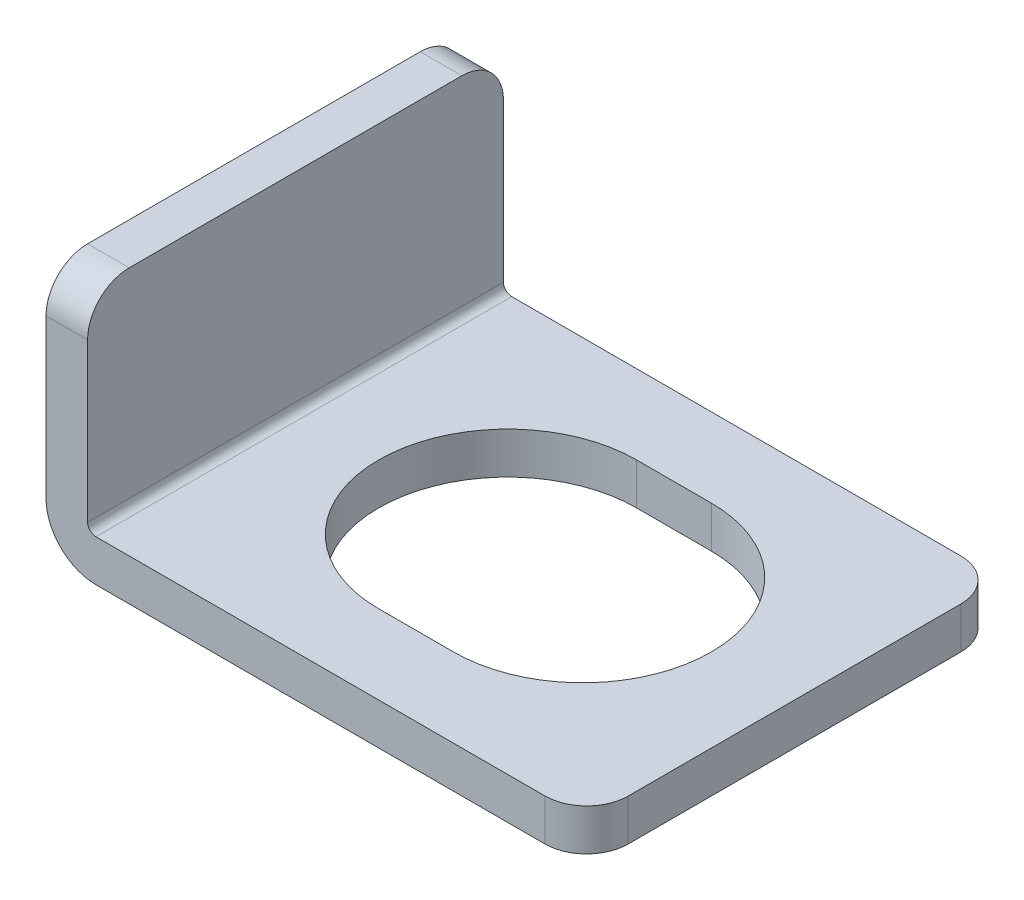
ISO-10303-21;
HEADER;
FILE_DESCRIPTION(('STEP AP214'),'2;1');
FILE_NAME('part.step','',(''),(''),'','','');
FILE_SCHEMA(('AUTOMOTIVE_DESIGN { 1 0 10303 214 1 1 1 1 }'));
ENDSEC;
DATA;
#1=APPLICATION_CONTEXT('core data for automotive mechanical design processes');
#2=APPLICATION_PROTOCOL_DEFINITION('international standard','automotive_design',2000,#1);
#3=PRODUCT_CONTEXT('',#1,'mechanical');
#4=PRODUCT('Part','Part','',(#3));
#5=PRODUCT_RELATED_PRODUCT_CATEGORY('part','',(#4));
#6=PRODUCT_DEFINITION_FORMATION('','',#4);
#7=PRODUCT_DEFINITION_CONTEXT('part definition',#1,'design');
#8=PRODUCT_DEFINITION('design','',#6,#7);
#9=PRODUCT_DEFINITION_SHAPE('','',#8);
#10=(LENGTH_UNIT() NAMED_UNIT(*) SI_UNIT(.MILLI.,.METRE.));
#11=(NAMED_UNIT(*) PLANE_ANGLE_UNIT() SI_UNIT($,.RADIAN.));
#12=(NAMED_UNIT(*) SI_UNIT($,.STERADIAN.) SOLID_ANGLE_UNIT());
#13=UNCERTAINTY_MEASURE_WITH_UNIT(LENGTH_MEASURE(1.E-05),#10,'distance_accuracy_value','');
#14=(GEOMETRIC_REPRESENTATION_CONTEXT(3) GLOBAL_UNCERTAINTY_ASSIGNED_CONTEXT((#13)) GLOBAL_UNIT_ASSIGNED_CONTEXT((#10,
#11,#12)) REPRESENTATION_CONTEXT('',''));
#15=CARTESIAN_POINT('',(0.,0.,0.));
#16=DIRECTION('',(0.,0.,1.));
#17=DIRECTION('',(1.,0.,0.));
#18=AXIS2_PLACEMENT_3D('',#15,#16,#17);
#19=CARTESIAN_POINT('',(0.,6.,5.));
#20=DIRECTION('',(0.,-1.,0.));
#21=DIRECTION('',(0.,0.,-1.));
#22=AXIS2_PLACEMENT_3D('',#19,#20,#21);
#23=PLANE('',#22);
#24=DIRECTION('',(0.,0.,-1.));
#25=VECTOR('',#24,1.);
#26=CARTESIAN_POINT('',(1.,6.,5.));
#27=LINE('',#26,#25);
#28=CARTESIAN_POINT('',(1.,6.,4.));
#29=VERTEX_POINT('',#28);
#30=CARTESIAN_POINT('',(1.,6.,-4.));
#31=VERTEX_POINT('',#30);
#32=EDGE_CURVE('E230',#29,#31,#27,.T.);
#33=ORIENTED_EDGE('',*,*,#32,.T.);
#34=DIRECTION('',(-1.,0.,0.));
#35=VECTOR('',#34,1.);
#36=CARTESIAN_POINT('',(0.,6.,-4.));
#37=LINE('',#36,#35);
#38=CARTESIAN_POINT('',(0.,6.,-4.));
#39=VERTEX_POINT('',#38);
#40=EDGE_CURVE('E283',#31,#39,#37,.T.);
#41=ORIENTED_EDGE('',*,*,#40,.T.);
#42=DIRECTION('',(0.,0.,-1.));
#43=VECTOR('',#42,1.);
#44=CARTESIAN_POINT('',(0.,6.,5.));
#45=LINE('',#44,#43);
#46=CARTESIAN_POINT('',(0.,6.,4.));
#47=VERTEX_POINT('',#46);
#48=EDGE_CURVE('E276',#47,#39,#45,.T.);
#49=ORIENTED_EDGE('',*,*,#48,.F.);
#50=DIRECTION('',(-1.,0.,0.));
#51=VECTOR('',#50,1.);
#52=CARTESIAN_POINT('',(0.,6.,4.));
#53=LINE('',#52,#51);
#54=EDGE_CURVE('E280',#47,#29,#53,.F.);
#55=ORIENTED_EDGE('',*,*,#54,.T.);
#56=EDGE_LOOP('',(#33,#41,#49,#55));
#57=FACE_BOUND('',#56,.T.);
#58=ADVANCED_FACE('F39',(#57),#23,.F.);
#59=CARTESIAN_POINT('',(0.,1.2,5.));
#60=DIRECTION('',(1.,0.,0.));
#61=DIRECTION('',(0.,0.,-1.));
#62=AXIS2_PLACEMENT_3D('',#59,#60,#61);
#63=PLANE('',#62);
#64=ORIENTED_EDGE('',*,*,#48,.T.);
#65=CARTESIAN_POINT('',(0.,5.,-4.));
#66=DIRECTION('',(1.,0.,0.));
#67=DIRECTION('',(0.,0.,-1.));
#68=AXIS2_PLACEMENT_3D('',#65,#66,#67);
#69=CIRCLE('',#68,1.);
#70=CARTESIAN_POINT('',(0.,5.,-5.));
#71=VERTEX_POINT('',#70);
#72=EDGE_CURVE('E290',#39,#71,#69,.F.);
#73=ORIENTED_EDGE('',*,*,#72,.T.);
#74=DIRECTION('',(0.,-1.,0.));
#75=VECTOR('',#74,1.);
#76=CARTESIAN_POINT('',(0.,1.2,-5.));
#77=LINE('',#76,#75);
#78=CARTESIAN_POINT('',(0.,1.2,-5.));
#79=VERTEX_POINT('',#78);
#80=EDGE_CURVE('E204',#71,#79,#77,.T.);
#81=ORIENTED_EDGE('',*,*,#80,.T.);
#82=DIRECTION('',(0.,0.,-1.));
#83=VECTOR('',#82,1.);
#84=CARTESIAN_POINT('',(0.,1.2,5.));
#85=LINE('',#84,#83);
#86=CARTESIAN_POINT('',(0.,1.2,5.));
#87=VERTEX_POINT('',#86);
#88=EDGE_CURVE('E272',#87,#79,#85,.T.);
#89=ORIENTED_EDGE('',*,*,#88,.F.);
#90=DIRECTION('',(0.,-1.,0.));
#91=VECTOR('',#90,1.);
#92=CARTESIAN_POINT('',(0.,1.2,5.));
#93=LINE('',#92,#91);
#94=CARTESIAN_POINT('',(0.,5.,5.));
#95=VERTEX_POINT('',#94);
#96=EDGE_CURVE('E210',#95,#87,#93,.T.);
#97=ORIENTED_EDGE('',*,*,#96,.F.);
#98=CARTESIAN_POINT('',(0.,5.,4.));
#99=DIRECTION('',(1.,0.,0.));
#100=DIRECTION('',(0.,0.,-1.));
#101=AXIS2_PLACEMENT_3D('',#98,#99,#100);
#102=CIRCLE('',#101,1.);
#103=EDGE_CURVE('E287',#95,#47,#102,.F.);
#104=ORIENTED_EDGE('',*,*,#103,.T.);
#105=EDGE_LOOP('',(#64,#73,#81,#89,#97,#104));
#106=FACE_BOUND('',#105,.T.);
#107=ADVANCED_FACE('F332',(#106),#63,.F.);
#108=CARTESIAN_POINT('',(1.2,1.2,5.));
#109=DIRECTION('',(0.,0.,-1.));
#110=DIRECTION('',(-1.,0.,0.));
#111=AXIS2_PLACEMENT_3D('',#108,#109,#110);
#112=CYLINDRICAL_SURFACE('',#111,1.2);
#113=CARTESIAN_POINT('',(1.2,1.2,-5.));
#114=DIRECTION('',(0.,0.,1.));
#115=DIRECTION('',(-1.,0.,0.));
#116=AXIS2_PLACEMENT_3D('',#113,#114,#115);
#117=CIRCLE('',#116,1.2);
#118=CARTESIAN_POINT('',(1.2,0.,-5.));
#119=VERTEX_POINT('',#118);
#120=EDGE_CURVE('E233',#79,#119,#117,.T.);
#121=ORIENTED_EDGE('',*,*,#120,.T.);
#122=DIRECTION('',(0.,0.,-1.));
#123=VECTOR('',#122,1.);
#124=CARTESIAN_POINT('',(1.2,0.,5.));
#125=LINE('',#124,#123);
#126=CARTESIAN_POINT('',(1.2,0.,5.));
#127=VERTEX_POINT('',#126);
#128=EDGE_CURVE('E268',#127,#119,#125,.T.);
#129=ORIENTED_EDGE('',*,*,#128,.F.);
#130=CARTESIAN_POINT('',(1.2,1.2,5.));
#131=DIRECTION('',(0.,0.,1.));
#132=DIRECTION('',(-1.,0.,0.));
#133=AXIS2_PLACEMENT_3D('',#130,#131,#132);
#134=CIRCLE('',#133,1.2);
#135=EDGE_CURVE('E213',#87,#127,#134,.T.);
#136=ORIENTED_EDGE('',*,*,#135,.F.);
#137=ORIENTED_EDGE('',*,*,#88,.T.);
#138=EDGE_LOOP('',(#121,#129,#136,#137));
#139=FACE_BOUND('',#138,.T.);
#140=ADVANCED_FACE('F339',(#139),#112,.T.);
#141=CARTESIAN_POINT('',(1.2,0.,5.));
#142=DIRECTION('',(0.,1.,0.));
#143=DIRECTION('',(0.,0.,1.));
#144=AXIS2_PLACEMENT_3D('',#141,#142,#143);
#145=PLANE('',#144);
#146=DIRECTION('',(-1.,0.,0.));
#147=VECTOR('',#146,1.);
#148=CARTESIAN_POINT('',(6.1,0.,-3.1));
#149=LINE('',#148,#147);
#150=CARTESIAN_POINT('',(7.9,0.,-3.1));
#151=VERTEX_POINT('',#150);
#152=CARTESIAN_POINT('',(6.1,0.,-3.1));
#153=VERTEX_POINT('',#152);
#154=EDGE_CURVE('E168',#151,#153,#149,.T.);
#155=ORIENTED_EDGE('',*,*,#154,.T.);
#156=CARTESIAN_POINT('',(6.1,0.,0.));
#157=DIRECTION('',(0.,1.,0.));
#158=DIRECTION('',(0.,0.,1.));
#159=AXIS2_PLACEMENT_3D('',#156,#157,#158);
#160=CIRCLE('',#159,3.1);
#161=CARTESIAN_POINT('',(6.1,0.,3.1));
#162=VERTEX_POINT('',#161);
#163=EDGE_CURVE('E159',#153,#162,#160,.T.);
#164=ORIENTED_EDGE('',*,*,#163,.T.);
#165=DIRECTION('',(1.,0.,0.));
#166=VECTOR('',#165,1.);
#167=CARTESIAN_POINT('',(6.1,0.,3.1));
#168=LINE('',#167,#166);
#169=CARTESIAN_POINT('',(7.9,0.,3.1));
#170=VERTEX_POINT('',#169);
#171=EDGE_CURVE('E172',#162,#170,#168,.T.);
#172=ORIENTED_EDGE('',*,*,#171,.T.);
#173=CARTESIAN_POINT('',(7.9,0.,0.));
#174=DIRECTION('',(0.,1.,0.));
#175=DIRECTION('',(0.,0.,1.));
#176=AXIS2_PLACEMENT_3D('',#173,#174,#175);
#177=CIRCLE('',#176,3.1);
#178=EDGE_CURVE('E177',#170,#151,#177,.T.);
#179=ORIENTED_EDGE('',*,*,#178,.T.);
#180=EDGE_LOOP('',(#155,#164,#172,#179));
#181=FACE_BOUND('',#180,.T.);
#182=DIRECTION('',(1.,0.,0.));
#183=VECTOR('',#182,1.);
#184=CARTESIAN_POINT('',(1.2,0.,-5.));
#185=LINE('',#184,#183);
#186=CARTESIAN_POINT('',(12.,0.,-5.));
#187=VERTEX_POINT('',#186);
#188=EDGE_CURVE('E236',#119,#187,#185,.T.);
#189=ORIENTED_EDGE('',*,*,#188,.T.);
#190=CARTESIAN_POINT('',(12.,0.,-4.));
#191=DIRECTION('',(0.,1.,0.));
#192=DIRECTION('',(0.,0.,1.));
#193=AXIS2_PLACEMENT_3D('',#190,#191,#192);
#194=CIRCLE('',#193,1.);
#195=CARTESIAN_POINT('',(13.,0.,-4.));
#196=VERTEX_POINT('',#195);
#197=EDGE_CURVE('E319',#187,#196,#194,.F.);
#198=ORIENTED_EDGE('',*,*,#197,.T.);
#199=DIRECTION('',(0.,0.,-1.));
#200=VECTOR('',#199,1.);
#201=CARTESIAN_POINT('',(13.,0.,5.));
#202=LINE('',#201,#200);
#203=CARTESIAN_POINT('',(13.,0.,4.));
#204=VERTEX_POINT('',#203);
#205=EDGE_CURVE('E264',#204,#196,#202,.T.);
#206=ORIENTED_EDGE('',*,*,#205,.F.);
#207=CARTESIAN_POINT('',(12.,0.,4.));
#208=DIRECTION('',(0.,1.,0.));
#209=DIRECTION('',(0.,0.,1.));
#210=AXIS2_PLACEMENT_3D('',#207,#208,#209);
#211=CIRCLE('',#210,1.);
#212=CARTESIAN_POINT('',(12.,0.,5.));
#213=VERTEX_POINT('',#212);
#214=EDGE_CURVE('E55',#204,#213,#211,.F.);
#215=ORIENTED_EDGE('',*,*,#214,.T.);
#216=DIRECTION('',(1.,0.,0.));
#217=VECTOR('',#216,1.);
#218=CARTESIAN_POINT('',(1.2,0.,5.));
#219=LINE('',#218,#217);
#220=EDGE_CURVE('E217',#127,#213,#219,.T.);
#221=ORIENTED_EDGE('',*,*,#220,.F.);
#222=ORIENTED_EDGE('',*,*,#128,.T.);
#223=EDGE_LOOP('',(#189,#198,#206,#215,#221,#222));
#224=FACE_BOUND('',#223,.T.);
#225=ADVANCED_FACE('F179',(#181,#224),#145,.F.);
#226=CARTESIAN_POINT('',(13.,1.,5.));
#227=DIRECTION('',(-1.,0.,0.));
#228=DIRECTION('',(0.,0.,1.));
#229=AXIS2_PLACEMENT_3D('',#226,#227,#228);
#230=PLANE('',#229);
#231=ORIENTED_EDGE('',*,*,#205,.T.);
#232=DIRECTION('',(0.,1.,0.));
#233=VECTOR('',#232,1.);
#234=CARTESIAN_POINT('',(13.,1.,-4.));
#235=LINE('',#234,#233);
#236=CARTESIAN_POINT('',(13.,1.,-4.));
#237=VERTEX_POINT('',#236);
#238=EDGE_CURVE('E308',#196,#237,#235,.T.);
#239=ORIENTED_EDGE('',*,*,#238,.T.);
#240=DIRECTION('',(0.,0.,-1.));
#241=VECTOR('',#240,1.);
#242=CARTESIAN_POINT('',(13.,1.,5.));
#243=LINE('',#242,#241);
#244=CARTESIAN_POINT('',(13.,1.,4.));
#245=VERTEX_POINT('',#244);
#246=EDGE_CURVE('E260',#245,#237,#243,.T.);
#247=ORIENTED_EDGE('',*,*,#246,.F.);
#248=DIRECTION('',(0.,1.,0.));
#249=VECTOR('',#248,1.);
#250=CARTESIAN_POINT('',(13.,1.,4.));
#251=LINE('',#250,#249);
#252=EDGE_CURVE('E305',#245,#204,#251,.F.);
#253=ORIENTED_EDGE('',*,*,#252,.T.);
#254=EDGE_LOOP('',(#231,#239,#247,#253));
#255=FACE_BOUND('',#254,.T.);
#256=ADVANCED_FACE('F344',(#255),#230,.F.);
#257=CARTESIAN_POINT('',(1.2,1.,5.));
#258=DIRECTION('',(0.,-1.,0.));
#259=DIRECTION('',(0.,0.,-1.));
#260=AXIS2_PLACEMENT_3D('',#257,#258,#259);
#261=PLANE('',#260);
#262=DIRECTION('',(1.,0.,0.));
#263=VECTOR('',#262,1.);
#264=CARTESIAN_POINT('',(6.1,1.,3.1));
#265=LINE('',#264,#263);
#266=CARTESIAN_POINT('',(6.1,1.,3.1));
#267=VERTEX_POINT('',#266);
#268=CARTESIAN_POINT('',(7.9,1.,3.1));
#269=VERTEX_POINT('',#268);
#270=EDGE_CURVE('E195',#267,#269,#265,.T.);
#271=ORIENTED_EDGE('',*,*,#270,.F.);
#272=CARTESIAN_POINT('',(6.1,1.,0.));
#273=DIRECTION('',(0.,1.,0.));
#274=DIRECTION('',(0.,0.,1.));
#275=AXIS2_PLACEMENT_3D('',#272,#273,#274);
#276=CIRCLE('',#275,3.1);
#277=CARTESIAN_POINT('',(6.1,1.,-3.1));
#278=VERTEX_POINT('',#277);
#279=EDGE_CURVE('E162',#278,#267,#276,.T.);
#280=ORIENTED_EDGE('',*,*,#279,.F.);
#281=DIRECTION('',(-1.,0.,0.));
#282=VECTOR('',#281,1.);
#283=CARTESIAN_POINT('',(6.1,1.,-3.1));
#284=LINE('',#283,#282);
#285=CARTESIAN_POINT('',(7.9,1.,-3.1));
#286=VERTEX_POINT('',#285);
#287=EDGE_CURVE('E182',#286,#278,#284,.T.);
#288=ORIENTED_EDGE('',*,*,#287,.F.);
#289=CARTESIAN_POINT('',(7.9,1.,0.));
#290=DIRECTION('',(0.,1.,0.));
#291=DIRECTION('',(0.,0.,1.));
#292=AXIS2_PLACEMENT_3D('',#289,#290,#291);
#293=CIRCLE('',#292,3.1);
#294=EDGE_CURVE('E187',#269,#286,#293,.T.);
#295=ORIENTED_EDGE('',*,*,#294,.F.);
#296=EDGE_LOOP('',(#271,#280,#288,#295));
#297=FACE_BOUND('',#296,.T.);
#298=ORIENTED_EDGE('',*,*,#246,.T.);
#299=CARTESIAN_POINT('',(12.,1.,-4.));
#300=DIRECTION('',(0.,-1.,0.));
#301=DIRECTION('',(0.,0.,-1.));
#302=AXIS2_PLACEMENT_3D('',#299,#300,#301);
#303=CIRCLE('',#302,1.);
#304=CARTESIAN_POINT('',(12.,1.,-5.));
#305=VERTEX_POINT('',#304);
#306=EDGE_CURVE('E314',#237,#305,#303,.F.);
#307=ORIENTED_EDGE('',*,*,#306,.T.);
#308=DIRECTION('',(-1.,0.,0.));
#309=VECTOR('',#308,1.);
#310=CARTESIAN_POINT('',(1.2,1.,-5.));
#311=LINE('',#310,#309);
#312=CARTESIAN_POINT('',(1.2,1.,-5.));
#313=VERTEX_POINT('',#312);
#314=EDGE_CURVE('E240',#305,#313,#311,.T.);
#315=ORIENTED_EDGE('',*,*,#314,.T.);
#316=DIRECTION('',(0.,0.,-1.));
#317=VECTOR('',#316,1.);
#318=CARTESIAN_POINT('',(1.2,1.,5.));
#319=LINE('',#318,#317);
#320=CARTESIAN_POINT('',(1.2,1.,5.));
#321=VERTEX_POINT('',#320);
#322=EDGE_CURVE('E256',#321,#313,#319,.T.);
#323=ORIENTED_EDGE('',*,*,#322,.F.);
#324=DIRECTION('',(-1.,0.,0.));
#325=VECTOR('',#324,1.);
#326=CARTESIAN_POINT('',(1.2,1.,5.));
#327=LINE('',#326,#325);
#328=CARTESIAN_POINT('',(12.,1.,5.));
#329=VERTEX_POINT('',#328);
#330=EDGE_CURVE('E220',#329,#321,#327,.T.);
#331=ORIENTED_EDGE('',*,*,#330,.F.);
#332=CARTESIAN_POINT('',(12.,1.,4.));
#333=DIRECTION('',(0.,-1.,0.));
#334=DIRECTION('',(0.,0.,-1.));
#335=AXIS2_PLACEMENT_3D('',#332,#333,#334);
#336=CIRCLE('',#335,1.);
#337=EDGE_CURVE('E63',#329,#245,#336,.F.);
#338=ORIENTED_EDGE('',*,*,#337,.T.);
#339=EDGE_LOOP('',(#298,#307,#315,#323,#331,#338));
#340=FACE_BOUND('',#339,.T.);
#341=ADVANCED_FACE('F352',(#297,#340),#261,.F.);
#342=CARTESIAN_POINT('',(1.2,1.2,5.));
#343=DIRECTION('',(0.,0.,-1.));
#344=DIRECTION('',(-1.,0.,0.));
#345=AXIS2_PLACEMENT_3D('',#342,#343,#344);
#346=CYLINDRICAL_SURFACE('',#345,0.2);
#347=CARTESIAN_POINT('',(1.2,1.2,-5.));
#348=DIRECTION('',(0.,0.,-1.));
#349=DIRECTION('',(-1.,0.,0.));
#350=AXIS2_PLACEMENT_3D('',#347,#348,#349);
#351=CIRCLE('',#350,0.2);
#352=CARTESIAN_POINT('',(1.,1.2,-5.));
#353=VERTEX_POINT('',#352);
#354=EDGE_CURVE('E243',#313,#353,#351,.T.);
#355=ORIENTED_EDGE('',*,*,#354,.T.);
#356=DIRECTION('',(0.,0.,-1.));
#357=VECTOR('',#356,1.);
#358=CARTESIAN_POINT('',(1.,1.2,5.));
#359=LINE('',#358,#357);
#360=CARTESIAN_POINT('',(1.,1.2,5.));
#361=VERTEX_POINT('',#360);
#362=EDGE_CURVE('E252',#361,#353,#359,.T.);
#363=ORIENTED_EDGE('',*,*,#362,.F.);
#364=CARTESIAN_POINT('',(1.2,1.2,5.));
#365=DIRECTION('',(0.,0.,-1.));
#366=DIRECTION('',(-1.,0.,0.));
#367=AXIS2_PLACEMENT_3D('',#364,#365,#366);
#368=CIRCLE('',#367,0.2);
#369=EDGE_CURVE('E223',#321,#361,#368,.T.);
#370=ORIENTED_EDGE('',*,*,#369,.F.);
#371=ORIENTED_EDGE('',*,*,#322,.T.);
#372=EDGE_LOOP('',(#355,#363,#370,#371));
#373=FACE_BOUND('',#372,.T.);
#374=ADVANCED_FACE('F358',(#373),#346,.F.);
#375=CARTESIAN_POINT('',(1.,1.2,5.));
#376=DIRECTION('',(-1.,0.,0.));
#377=DIRECTION('',(0.,0.,1.));
#378=AXIS2_PLACEMENT_3D('',#375,#376,#377);
#379=PLANE('',#378);
#380=DIRECTION('',(0.,1.,0.));
#381=VECTOR('',#380,1.);
#382=CARTESIAN_POINT('',(1.,1.2,-5.));
#383=LINE('',#382,#381);
#384=CARTESIAN_POINT('',(1.,5.,-5.));
#385=VERTEX_POINT('',#384);
#386=EDGE_CURVE('E214',#353,#385,#383,.T.);
#387=ORIENTED_EDGE('',*,*,#386,.T.);
#388=CARTESIAN_POINT('',(1.,5.,-4.));
#389=DIRECTION('',(-1.,0.,0.));
#390=DIRECTION('',(0.,0.,1.));
#391=AXIS2_PLACEMENT_3D('',#388,#389,#390);
#392=CIRCLE('',#391,1.);
#393=EDGE_CURVE('E302',#385,#31,#392,.F.);
#394=ORIENTED_EDGE('',*,*,#393,.T.);
#395=ORIENTED_EDGE('',*,*,#32,.F.);
#396=CARTESIAN_POINT('',(1.,5.,4.));
#397=DIRECTION('',(-1.,0.,0.));
#398=DIRECTION('',(0.,0.,1.));
#399=AXIS2_PLACEMENT_3D('',#396,#397,#398);
#400=CIRCLE('',#399,1.);
#401=CARTESIAN_POINT('',(1.,5.,5.));
#402=VERTEX_POINT('',#401);
#403=EDGE_CURVE('E299',#29,#402,#400,.F.);
#404=ORIENTED_EDGE('',*,*,#403,.T.);
#405=DIRECTION('',(0.,1.,0.));
#406=VECTOR('',#405,1.);
#407=CARTESIAN_POINT('',(1.,1.2,5.));
#408=LINE('',#407,#406);
#409=EDGE_CURVE('E226',#361,#402,#408,.T.);
#410=ORIENTED_EDGE('',*,*,#409,.F.);
#411=ORIENTED_EDGE('',*,*,#362,.T.);
#412=EDGE_LOOP('',(#387,#394,#395,#404,#410,#411));
#413=FACE_BOUND('',#412,.T.);
#414=ADVANCED_FACE('F362',(#413),#379,.F.);
#415=CARTESIAN_POINT('',(1.2,1.2,5.));
#416=DIRECTION('',(0.,0.,-1.));
#417=DIRECTION('',(-1.,0.,0.));
#418=AXIS2_PLACEMENT_3D('',#415,#416,#417);
#419=PLANE('',#418);
#420=ORIENTED_EDGE('',*,*,#220,.T.);
#421=DIRECTION('',(0.,1.,0.));
#422=VECTOR('',#421,1.);
#423=CARTESIAN_POINT('',(12.,1.2,5.));
#424=LINE('',#423,#422);
#425=EDGE_CURVE('E11',#213,#329,#424,.T.);
#426=ORIENTED_EDGE('',*,*,#425,.T.);
#427=ORIENTED_EDGE('',*,*,#330,.T.);
#428=ORIENTED_EDGE('',*,*,#369,.T.);
#429=ORIENTED_EDGE('',*,*,#409,.T.);
#430=DIRECTION('',(-1.,0.,0.));
#431=VECTOR('',#430,1.);
#432=CARTESIAN_POINT('',(1.2,5.,5.));
#433=LINE('',#432,#431);
#434=EDGE_CURVE('E48',#402,#95,#433,.T.);
#435=ORIENTED_EDGE('',*,*,#434,.T.);
#436=ORIENTED_EDGE('',*,*,#96,.T.);
#437=ORIENTED_EDGE('',*,*,#135,.T.);
#438=EDGE_LOOP('',(#420,#426,#427,#428,#429,#435,#436,#437));
#439=FACE_BOUND('',#438,.T.);
#440=ADVANCED_FACE('F326',(#439),#419,.F.);
#441=CARTESIAN_POINT('',(1.2,1.2,-5.));
#442=DIRECTION('',(0.,0.,-1.));
#443=DIRECTION('',(-1.,0.,0.));
#444=AXIS2_PLACEMENT_3D('',#441,#442,#443);
#445=PLANE('',#444);
#446=ORIENTED_EDGE('',*,*,#80,.F.);
#447=DIRECTION('',(-1.,0.,0.));
#448=VECTOR('',#447,1.);
#449=CARTESIAN_POINT('',(1.,5.,-5.));
#450=LINE('',#449,#448);
#451=EDGE_CURVE('E296',#71,#385,#450,.F.);
#452=ORIENTED_EDGE('',*,*,#451,.T.);
#453=ORIENTED_EDGE('',*,*,#386,.F.);
#454=ORIENTED_EDGE('',*,*,#354,.F.);
#455=ORIENTED_EDGE('',*,*,#314,.F.);
#456=DIRECTION('',(0.,1.,0.));
#457=VECTOR('',#456,1.);
#458=CARTESIAN_POINT('',(12.,0.,-5.));
#459=LINE('',#458,#457);
#460=EDGE_CURVE('E293',#305,#187,#459,.F.);
#461=ORIENTED_EDGE('',*,*,#460,.T.);
#462=ORIENTED_EDGE('',*,*,#188,.F.);
#463=ORIENTED_EDGE('',*,*,#120,.F.);
#464=EDGE_LOOP('',(#446,#452,#453,#454,#455,#461,#462,#463));
#465=FACE_BOUND('',#464,.T.);
#466=ADVANCED_FACE('F370',(#465),#445,.T.);
#467=CARTESIAN_POINT('',(6.1,0.,0.));
#468=DIRECTION('',(0.,1.,0.));
#469=DIRECTION('',(0.,0.,1.));
#470=AXIS2_PLACEMENT_3D('',#467,#468,#469);
#471=CYLINDRICAL_SURFACE('',#470,3.1);
#472=ORIENTED_EDGE('',*,*,#279,.T.);
#473=DIRECTION('',(0.,1.,0.));
#474=VECTOR('',#473,1.);
#475=CARTESIAN_POINT('',(6.1,0.,3.1));
#476=LINE('',#475,#474);
#477=EDGE_CURVE('E155',#162,#267,#476,.T.);
#478=ORIENTED_EDGE('',*,*,#477,.F.);
#479=ORIENTED_EDGE('',*,*,#163,.F.);
#480=DIRECTION('',(0.,1.,0.));
#481=VECTOR('',#480,1.);
#482=CARTESIAN_POINT('',(6.1,0.,-3.1));
#483=LINE('',#482,#481);
#484=EDGE_CURVE('E201',#153,#278,#483,.T.);
#485=ORIENTED_EDGE('',*,*,#484,.T.);
#486=EDGE_LOOP('',(#472,#478,#479,#485));
#487=FACE_BOUND('',#486,.T.);
#488=ADVANCED_FACE('F157',(#487),#471,.F.);
#489=CARTESIAN_POINT('',(6.1,0.,-3.1));
#490=DIRECTION('',(0.,0.,-1.));
#491=DIRECTION('',(-1.,0.,0.));
#492=AXIS2_PLACEMENT_3D('',#489,#490,#491);
#493=PLANE('',#492);
#494=ORIENTED_EDGE('',*,*,#287,.T.);
#495=ORIENTED_EDGE('',*,*,#484,.F.);
#496=ORIENTED_EDGE('',*,*,#154,.F.);
#497=DIRECTION('',(0.,1.,0.));
#498=VECTOR('',#497,1.);
#499=CARTESIAN_POINT('',(7.9,0.,-3.1));
#500=LINE('',#499,#498);
#501=EDGE_CURVE('E205',#151,#286,#500,.T.);
#502=ORIENTED_EDGE('',*,*,#501,.T.);
#503=EDGE_LOOP('',(#494,#495,#496,#502));
#504=FACE_BOUND('',#503,.T.);
#505=ADVANCED_FACE('F407',(#504),#493,.F.);
#506=CARTESIAN_POINT('',(7.9,0.,0.));
#507=DIRECTION('',(0.,1.,0.));
#508=DIRECTION('',(0.,0.,1.));
#509=AXIS2_PLACEMENT_3D('',#506,#507,#508);
#510=CYLINDRICAL_SURFACE('',#509,3.1);
#511=ORIENTED_EDGE('',*,*,#294,.T.);
#512=ORIENTED_EDGE('',*,*,#501,.F.);
#513=ORIENTED_EDGE('',*,*,#178,.F.);
#514=DIRECTION('',(0.,1.,0.));
#515=VECTOR('',#514,1.);
#516=CARTESIAN_POINT('',(7.9,0.,3.1));
#517=LINE('',#516,#515);
#518=EDGE_CURVE('E167',#170,#269,#517,.T.);
#519=ORIENTED_EDGE('',*,*,#518,.T.);
#520=EDGE_LOOP('',(#511,#512,#513,#519));
#521=FACE_BOUND('',#520,.T.);
#522=ADVANCED_FACE('F380',(#521),#510,.F.);
#523=CARTESIAN_POINT('',(6.1,0.,3.1));
#524=DIRECTION('',(0.,0.,1.));
#525=DIRECTION('',(1.,0.,0.));
#526=AXIS2_PLACEMENT_3D('',#523,#524,#525);
#527=PLANE('',#526);
#528=ORIENTED_EDGE('',*,*,#270,.T.);
#529=ORIENTED_EDGE('',*,*,#518,.F.);
#530=ORIENTED_EDGE('',*,*,#171,.F.);
#531=ORIENTED_EDGE('',*,*,#477,.T.);
#532=EDGE_LOOP('',(#528,#529,#530,#531));
#533=FACE_BOUND('',#532,.T.);
#534=ADVANCED_FACE('F173',(#533),#527,.F.);
#535=CARTESIAN_POINT('',(0.,5.,-4.));
#536=DIRECTION('',(1.,0.,0.));
#537=DIRECTION('',(0.,0.,-1.));
#538=AXIS2_PLACEMENT_3D('',#535,#536,#537);
#539=CYLINDRICAL_SURFACE('',#538,1.);
#540=ORIENTED_EDGE('',*,*,#393,.F.);
#541=ORIENTED_EDGE('',*,*,#451,.F.);
#542=ORIENTED_EDGE('',*,*,#72,.F.);
#543=ORIENTED_EDGE('',*,*,#40,.F.);
#544=EDGE_LOOP('',(#540,#541,#542,#543));
#545=FACE_BOUND('',#544,.T.);
#546=ADVANCED_FACE('F372',(#545),#539,.T.);
#547=CARTESIAN_POINT('',(12.,1.,-4.));
#548=DIRECTION('',(0.,-1.,0.));
#549=DIRECTION('',(0.,0.,-1.));
#550=AXIS2_PLACEMENT_3D('',#547,#548,#549);
#551=CYLINDRICAL_SURFACE('',#550,1.);
#552=ORIENTED_EDGE('',*,*,#197,.F.);
#553=ORIENTED_EDGE('',*,*,#460,.F.);
#554=ORIENTED_EDGE('',*,*,#306,.F.);
#555=ORIENTED_EDGE('',*,*,#238,.F.);
#556=EDGE_LOOP('',(#552,#553,#554,#555));
#557=FACE_BOUND('',#556,.T.);
#558=ADVANCED_FACE('F350',(#557),#551,.T.);
#559=CARTESIAN_POINT('',(12.,1.2,4.));
#560=DIRECTION('',(0.,1.,0.));
#561=DIRECTION('',(0.,0.,1.));
#562=AXIS2_PLACEMENT_3D('',#559,#560,#561);
#563=CYLINDRICAL_SURFACE('',#562,1.);
#564=ORIENTED_EDGE('',*,*,#214,.F.);
#565=ORIENTED_EDGE('',*,*,#252,.F.);
#566=ORIENTED_EDGE('',*,*,#337,.F.);
#567=ORIENTED_EDGE('',*,*,#425,.F.);
#568=EDGE_LOOP('',(#564,#565,#566,#567));
#569=FACE_BOUND('',#568,.T.);
#570=ADVANCED_FACE('F341',(#569),#563,.T.);
#571=CARTESIAN_POINT('',(1.2,5.,4.));
#572=DIRECTION('',(-1.,0.,0.));
#573=DIRECTION('',(0.,0.,1.));
#574=AXIS2_PLACEMENT_3D('',#571,#572,#573);
#575=CYLINDRICAL_SURFACE('',#574,1.);
#576=ORIENTED_EDGE('',*,*,#403,.F.);
#577=ORIENTED_EDGE('',*,*,#54,.F.);
#578=ORIENTED_EDGE('',*,*,#103,.F.);
#579=ORIENTED_EDGE('',*,*,#434,.F.);
#580=EDGE_LOOP('',(#576,#577,#578,#579));
#581=FACE_BOUND('',#580,.T.);
#582=ADVANCED_FACE('F41',(#581),#575,.T.);
#583=CLOSED_SHELL('',(#58,#107,#140,#225,#256,#341,#374,#414,#440,#466,#488,#505,#522,#534,#546,
#558,#570,#582));
#584=MANIFOLD_SOLID_BREP('B2',#583);
#585=ADVANCED_BREP_SHAPE_REPRESENTATION('',(#18,#584),#14);
#586=SHAPE_DEFINITION_REPRESENTATION(#9,#585);
ENDSEC;
END-ISO-10303-21;
